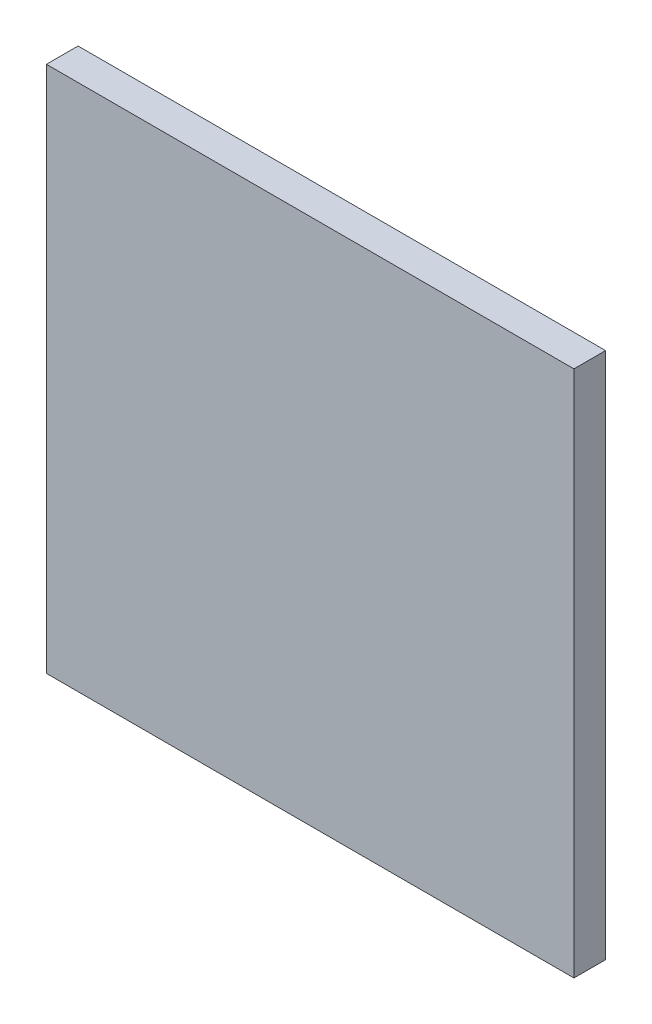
ISO-10303-21;
HEADER;
FILE_DESCRIPTION(('STEP AP214'),'2;1');
FILE_NAME('part.step','',(''),(''),'','','');
FILE_SCHEMA(('AUTOMOTIVE_DESIGN { 1 0 10303 214 1 1 1 1 }'));
ENDSEC;
DATA;
#1=APPLICATION_CONTEXT('core data for automotive mechanical design processes');
#2=APPLICATION_PROTOCOL_DEFINITION('international standard','automotive_design',2000,#1);
#3=PRODUCT_CONTEXT('',#1,'mechanical');
#4=PRODUCT('Part','Part','',(#3));
#5=PRODUCT_RELATED_PRODUCT_CATEGORY('part','',(#4));
#6=PRODUCT_DEFINITION_FORMATION('','',#4);
#7=PRODUCT_DEFINITION_CONTEXT('part definition',#1,'design');
#8=PRODUCT_DEFINITION('design','',#6,#7);
#9=PRODUCT_DEFINITION_SHAPE('','',#8);
#10=(LENGTH_UNIT() NAMED_UNIT(*) SI_UNIT(.MILLI.,.METRE.));
#11=(NAMED_UNIT(*) PLANE_ANGLE_UNIT() SI_UNIT($,.RADIAN.));
#12=(NAMED_UNIT(*) SI_UNIT($,.STERADIAN.) SOLID_ANGLE_UNIT());
#13=UNCERTAINTY_MEASURE_WITH_UNIT(LENGTH_MEASURE(1.E-05),#10,'distance_accuracy_value','');
#14=(GEOMETRIC_REPRESENTATION_CONTEXT(3) GLOBAL_UNCERTAINTY_ASSIGNED_CONTEXT((#13)) GLOBAL_UNIT_ASSIGNED_CONTEXT((#10,
#11,#12)) REPRESENTATION_CONTEXT('',''));
#15=CARTESIAN_POINT('',(0.,0.,0.));
#16=DIRECTION('',(0.,0.,1.));
#17=DIRECTION('',(1.,0.,0.));
#18=AXIS2_PLACEMENT_3D('',#15,#16,#17);
#19=CARTESIAN_POINT('',(0.,0.,12.));
#20=DIRECTION('',(0.,0.,1.));
#21=DIRECTION('',(1.,0.,0.));
#22=AXIS2_PLACEMENT_3D('',#19,#20,#21);
#23=PLANE('',#22);
#24=DIRECTION('',(1.,0.,0.));
#25=VECTOR('',#24,1.);
#26=CARTESIAN_POINT('',(-100.,-100.,12.));
#27=LINE('',#26,#25);
#28=CARTESIAN_POINT('',(-100.,-100.,12.));
#29=VERTEX_POINT('',#28);
#30=CARTESIAN_POINT('',(100.,-100.,12.));
#31=VERTEX_POINT('',#30);
#32=EDGE_CURVE('E79',#29,#31,#27,.T.);
#33=ORIENTED_EDGE('',*,*,#32,.T.);
#34=DIRECTION('',(0.,1.,0.));
#35=VECTOR('',#34,1.);
#36=CARTESIAN_POINT('',(100.,-100.,12.));
#37=LINE('',#36,#35);
#38=CARTESIAN_POINT('',(100.,100.,12.));
#39=VERTEX_POINT('',#38);
#40=EDGE_CURVE('E101',#31,#39,#37,.T.);
#41=ORIENTED_EDGE('',*,*,#40,.T.);
#42=DIRECTION('',(-1.,0.,0.));
#43=VECTOR('',#42,1.);
#44=CARTESIAN_POINT('',(100.,100.,12.));
#45=LINE('',#44,#43);
#46=CARTESIAN_POINT('',(-100.,100.,12.));
#47=VERTEX_POINT('',#46);
#48=EDGE_CURVE('E72',#39,#47,#45,.T.);
#49=ORIENTED_EDGE('',*,*,#48,.T.);
#50=DIRECTION('',(0.,-1.,0.));
#51=VECTOR('',#50,1.);
#52=CARTESIAN_POINT('',(-100.,100.,12.));
#53=LINE('',#52,#51);
#54=EDGE_CURVE('E10',#47,#29,#53,.T.);
#55=ORIENTED_EDGE('',*,*,#54,.T.);
#56=EDGE_LOOP('',(#33,#41,#49,#55));
#57=FACE_BOUND('',#56,.T.);
#58=ADVANCED_FACE('F16',(#57),#23,.T.);
#59=CARTESIAN_POINT('',(0.,0.,0.));
#60=DIRECTION('',(0.,0.,1.));
#61=DIRECTION('',(1.,0.,0.));
#62=AXIS2_PLACEMENT_3D('',#59,#60,#61);
#63=PLANE('',#62);
#64=DIRECTION('',(0.,-1.,0.));
#65=VECTOR('',#64,1.);
#66=CARTESIAN_POINT('',(-100.,100.,0.));
#67=LINE('',#66,#65);
#68=CARTESIAN_POINT('',(-100.,100.,0.));
#69=VERTEX_POINT('',#68);
#70=CARTESIAN_POINT('',(-100.,-100.,0.));
#71=VERTEX_POINT('',#70);
#72=EDGE_CURVE('E19',#69,#71,#67,.T.);
#73=ORIENTED_EDGE('',*,*,#72,.F.);
#74=DIRECTION('',(-1.,0.,0.));
#75=VECTOR('',#74,1.);
#76=CARTESIAN_POINT('',(100.,100.,0.));
#77=LINE('',#76,#75);
#78=CARTESIAN_POINT('',(100.,100.,0.));
#79=VERTEX_POINT('',#78);
#80=EDGE_CURVE('E105',#79,#69,#77,.T.);
#81=ORIENTED_EDGE('',*,*,#80,.F.);
#82=DIRECTION('',(0.,1.,0.));
#83=VECTOR('',#82,1.);
#84=CARTESIAN_POINT('',(100.,-100.,0.));
#85=LINE('',#84,#83);
#86=CARTESIAN_POINT('',(100.,-100.,0.));
#87=VERTEX_POINT('',#86);
#88=EDGE_CURVE('E81',#87,#79,#85,.T.);
#89=ORIENTED_EDGE('',*,*,#88,.F.);
#90=DIRECTION('',(1.,0.,0.));
#91=VECTOR('',#90,1.);
#92=CARTESIAN_POINT('',(-100.,-100.,0.));
#93=LINE('',#92,#91);
#94=EDGE_CURVE('E77',#71,#87,#93,.T.);
#95=ORIENTED_EDGE('',*,*,#94,.F.);
#96=EDGE_LOOP('',(#73,#81,#89,#95));
#97=FACE_BOUND('',#96,.T.);
#98=ADVANCED_FACE('F83',(#97),#63,.F.);
#99=CARTESIAN_POINT('',(-100.,100.,0.));
#100=DIRECTION('',(1.,0.,0.));
#101=DIRECTION('',(0.,1.,0.));
#102=AXIS2_PLACEMENT_3D('',#99,#100,#101);
#103=PLANE('',#102);
#104=ORIENTED_EDGE('',*,*,#72,.T.);
#105=DIRECTION('',(0.,0.,1.));
#106=VECTOR('',#105,1.);
#107=CARTESIAN_POINT('',(-100.,-100.,0.));
#108=LINE('',#107,#106);
#109=EDGE_CURVE('E64',#71,#29,#108,.T.);
#110=ORIENTED_EDGE('',*,*,#109,.T.);
#111=ORIENTED_EDGE('',*,*,#54,.F.);
#112=DIRECTION('',(0.,0.,1.));
#113=VECTOR('',#112,1.);
#114=CARTESIAN_POINT('',(-100.,100.,0.));
#115=LINE('',#114,#113);
#116=EDGE_CURVE('E67',#69,#47,#115,.T.);
#117=ORIENTED_EDGE('',*,*,#116,.F.);
#118=EDGE_LOOP('',(#104,#110,#111,#117));
#119=FACE_BOUND('',#118,.T.);
#120=ADVANCED_FACE('F63',(#119),#103,.F.);
#121=CARTESIAN_POINT('',(100.,100.,0.));
#122=DIRECTION('',(0.,-1.,0.));
#123=DIRECTION('',(0.,0.,-1.));
#124=AXIS2_PLACEMENT_3D('',#121,#122,#123);
#125=PLANE('',#124);
#126=ORIENTED_EDGE('',*,*,#80,.T.);
#127=ORIENTED_EDGE('',*,*,#116,.T.);
#128=ORIENTED_EDGE('',*,*,#48,.F.);
#129=DIRECTION('',(0.,0.,1.));
#130=VECTOR('',#129,1.);
#131=CARTESIAN_POINT('',(100.,100.,0.));
#132=LINE('',#131,#130);
#133=EDGE_CURVE('E97',#79,#39,#132,.T.);
#134=ORIENTED_EDGE('',*,*,#133,.F.);
#135=EDGE_LOOP('',(#126,#127,#128,#134));
#136=FACE_BOUND('',#135,.T.);
#137=ADVANCED_FACE('F114',(#136),#125,.F.);
#138=CARTESIAN_POINT('',(100.,-100.,0.));
#139=DIRECTION('',(-1.,0.,0.));
#140=DIRECTION('',(0.,0.,1.));
#141=AXIS2_PLACEMENT_3D('',#138,#139,#140);
#142=PLANE('',#141);
#143=ORIENTED_EDGE('',*,*,#88,.T.);
#144=ORIENTED_EDGE('',*,*,#133,.T.);
#145=ORIENTED_EDGE('',*,*,#40,.F.);
#146=DIRECTION('',(0.,0.,1.));
#147=VECTOR('',#146,1.);
#148=CARTESIAN_POINT('',(100.,-100.,0.));
#149=LINE('',#148,#147);
#150=EDGE_CURVE('E87',#87,#31,#149,.T.);
#151=ORIENTED_EDGE('',*,*,#150,.F.);
#152=EDGE_LOOP('',(#143,#144,#145,#151));
#153=FACE_BOUND('',#152,.T.);
#154=ADVANCED_FACE('F116',(#153),#142,.F.);
#155=CARTESIAN_POINT('',(-100.,-100.,0.));
#156=DIRECTION('',(0.,1.,0.));
#157=DIRECTION('',(1.,0.,0.));
#158=AXIS2_PLACEMENT_3D('',#155,#156,#157);
#159=PLANE('',#158);
#160=ORIENTED_EDGE('',*,*,#94,.T.);
#161=ORIENTED_EDGE('',*,*,#150,.T.);
#162=ORIENTED_EDGE('',*,*,#32,.F.);
#163=ORIENTED_EDGE('',*,*,#109,.F.);
#164=EDGE_LOOP('',(#160,#161,#162,#163));
#165=FACE_BOUND('',#164,.T.);
#166=ADVANCED_FACE('F75',(#165),#159,.F.);
#167=CLOSED_SHELL('',(#58,#98,#120,#137,#154,#166));
#168=MANIFOLD_SOLID_BREP('B1',#167);
#169=ADVANCED_BREP_SHAPE_REPRESENTATION('',(#18,#168),#14);
#170=SHAPE_DEFINITION_REPRESENTATION(#9,#169);
ENDSEC;
END-ISO-10303-21;
